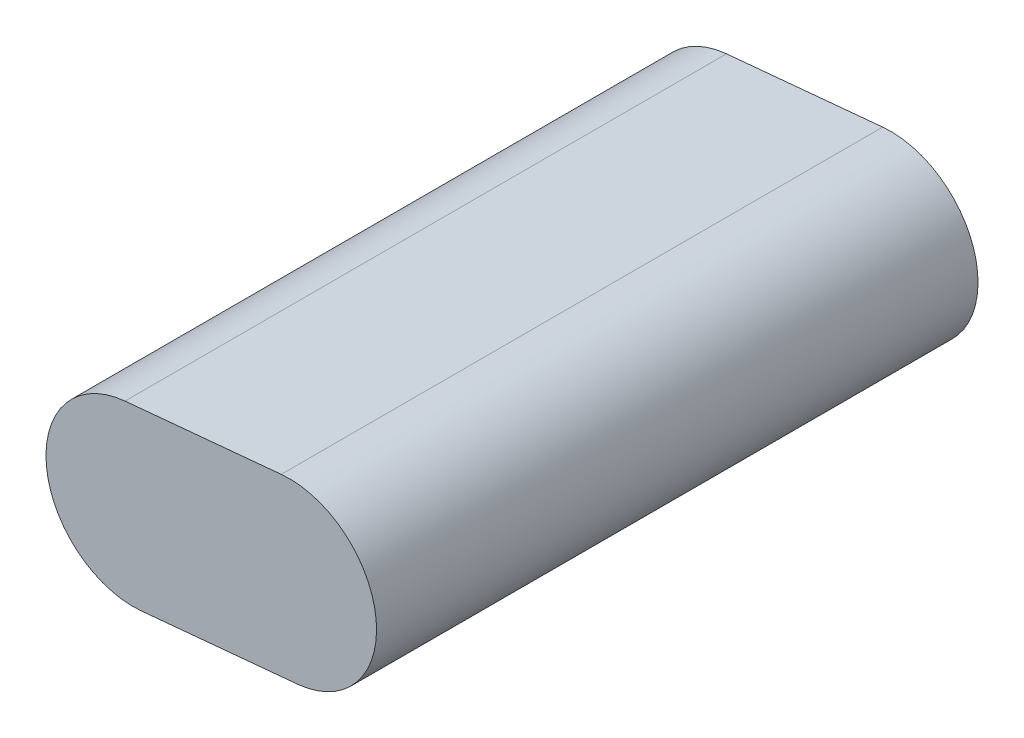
from build123d import *

# Parameters (mm, degrees)
BOSS_EXTRUDE1_DEPTH = 65
BOSS_EXTRUDE2_DEPTH = 2
BOSS_EXTRUDE3_START = 2
BOSS_EXTRUDE3_DEPTH = 2


with BuildPart() as part:
    # Sketch1 → Boss-Extrude1 (new body)
    with BuildSketch(Plane.XY):
        with BuildLine():
            Line((0.933851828, -9.956300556), (18.855192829, -8.275367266))
            ThreePointArc((18.855192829, -8.275367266), (27.877641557, 2.614785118), (16.987489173, 11.637233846))
            Line((16.987489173, 11.637233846), (-0.933851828, 9.956300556))
            ThreePointArc((-0.933851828, 9.956300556), (-9.956300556, -0.933851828), (0.933851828, -9.956300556))
        make_face()
        with BuildLine():
            Line((-0.840466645, 8.960670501), (17.080874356, 10.64160379))
            ThreePointArc((17.080874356, 10.64160379), (26.882011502, 2.521399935), (18.761807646, -7.279737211))
            Line((18.761807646, -7.279737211), (0.840466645, -8.960670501))
            ThreePointArc((0.840466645, -8.960670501), (-8.960670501, -0.840466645), (-0.840466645, 8.960670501))
        make_face(mode=Mode.SUBTRACT)
    extrude(amount=-BOSS_EXTRUDE1_DEPTH)

    # Sketch2 → Boss-Extrude2 (add)
    with BuildSketch(Plane(origin=(0, 0, -65), x_dir=(-1, 0, 0), z_dir=(0, 0, -1))):
        with BuildLine():
            Line((0.933851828, 9.956300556), (-16.987489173, 11.637233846))
            ThreePointArc((-16.987489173, 11.637233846), (-27.877641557, 2.614785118), (-18.855192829, -8.275367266))
            Line((-18.855192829, -8.275367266), (-0.933851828, -9.956300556))
            ThreePointArc((-0.933851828, -9.956300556), (9.956300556, -0.933851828), (0.933851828, 9.956300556))
        make_face()
    extrude(amount=BOSS_EXTRUDE2_DEPTH)

    # Sketch3 → Boss-Extrude3 (add)
    with BuildSketch(Plane.XY.offset(BOSS_EXTRUDE3_START)):
        with BuildLine():
            Line((0.933851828, -9.956300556), (18.855192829, -8.275367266))
            ThreePointArc((18.855192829, -8.275367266), (27.877641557, 2.614785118), (16.987489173, 11.637233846))
            Line((16.987489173, 11.637233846), (-0.933851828, 9.956300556))
            ThreePointArc((-0.933851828, 9.956300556), (-9.956300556, -0.933851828), (0.933851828, -9.956300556))
        make_face()
    extrude(amount=-BOSS_EXTRUDE3_DEPTH)


solid = part.part
